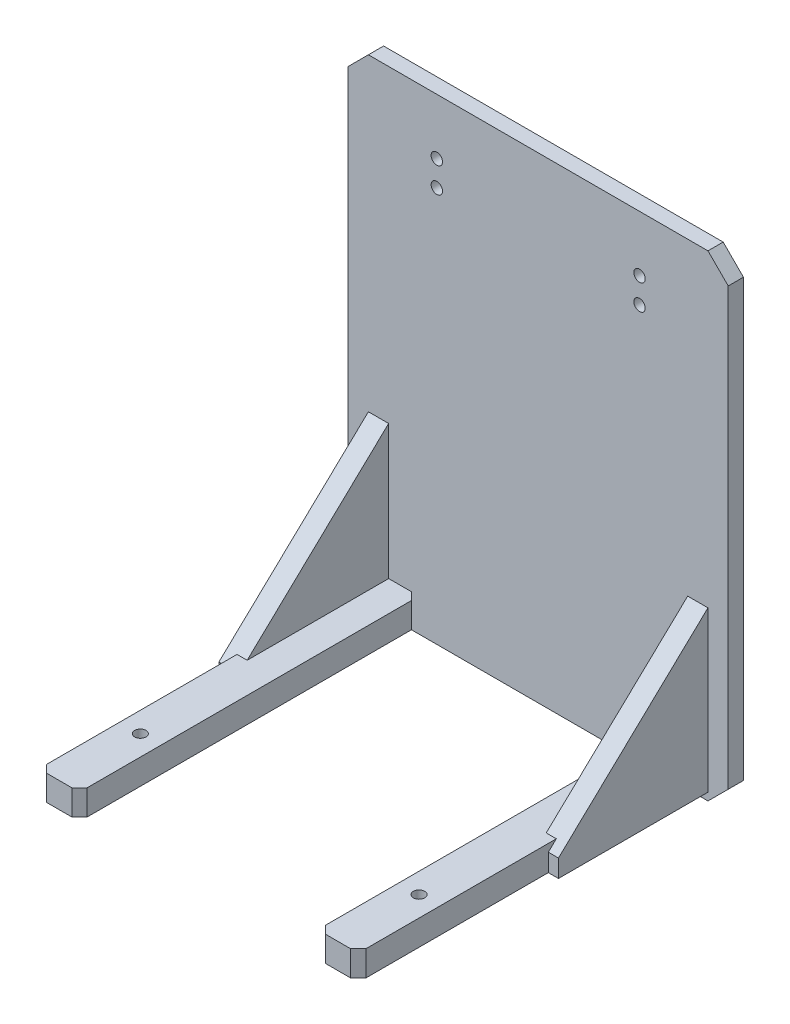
ISO-10303-21;
HEADER;
FILE_DESCRIPTION(('STEP AP214'),'2;1');
FILE_NAME('part.step','',(''),(''),'','','');
FILE_SCHEMA(('AUTOMOTIVE_DESIGN { 1 0 10303 214 1 1 1 1 }'));
ENDSEC;
DATA;
#1=APPLICATION_CONTEXT('core data for automotive mechanical design processes');
#2=APPLICATION_PROTOCOL_DEFINITION('international standard','automotive_design',2000,#1);
#3=PRODUCT_CONTEXT('',#1,'mechanical');
#4=PRODUCT('Part','Part','',(#3));
#5=PRODUCT_RELATED_PRODUCT_CATEGORY('part','',(#4));
#6=PRODUCT_DEFINITION_FORMATION('','',#4);
#7=PRODUCT_DEFINITION_CONTEXT('part definition',#1,'design');
#8=PRODUCT_DEFINITION('design','',#6,#7);
#9=PRODUCT_DEFINITION_SHAPE('','',#8);
#10=(LENGTH_UNIT() NAMED_UNIT(*) SI_UNIT(.MILLI.,.METRE.));
#11=(NAMED_UNIT(*) PLANE_ANGLE_UNIT() SI_UNIT($,.RADIAN.));
#12=(NAMED_UNIT(*) SI_UNIT($,.STERADIAN.) SOLID_ANGLE_UNIT());
#13=UNCERTAINTY_MEASURE_WITH_UNIT(LENGTH_MEASURE(1.E-05),#10,'distance_accuracy_value','');
#14=(GEOMETRIC_REPRESENTATION_CONTEXT(3) GLOBAL_UNCERTAINTY_ASSIGNED_CONTEXT((#13)) GLOBAL_UNIT_ASSIGNED_CONTEXT((#10,
#11,#12)) REPRESENTATION_CONTEXT('',''));
#15=CARTESIAN_POINT('',(0.,0.,0.));
#16=DIRECTION('',(0.,0.,1.));
#17=DIRECTION('',(1.,0.,0.));
#18=AXIS2_PLACEMENT_3D('',#15,#16,#17);
#19=CARTESIAN_POINT('',(0.,0.,6.));
#20=DIRECTION('',(0.,0.,1.));
#21=DIRECTION('',(1.,0.,0.));
#22=AXIS2_PLACEMENT_3D('',#19,#20,#21);
#23=PLANE('',#22);
#24=DIRECTION('',(0.,1.,0.));
#25=VECTOR('',#24,1.);
#26=CARTESIAN_POINT('',(-59.,-105.,6.));
#27=LINE('',#26,#25);
#28=CARTESIAN_POINT('',(-59.,-95.,6.00000000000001));
#29=VERTEX_POINT('',#28);
#30=CARTESIAN_POINT('',(-59.,-42.,6.));
#31=VERTEX_POINT('',#30);
#32=EDGE_CURVE('E277',#29,#31,#27,.T.);
#33=ORIENTED_EDGE('',*,*,#32,.F.);
#34=DIRECTION('',(-1.,0.,0.));
#35=VECTOR('',#34,1.);
#36=CARTESIAN_POINT('',(-60.,-95.,6.00000000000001));
#37=LINE('',#36,#35);
#38=CARTESIAN_POINT('',(-50.,-95.,6.00000000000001));
#39=VERTEX_POINT('',#38);
#40=EDGE_CURVE('E327',#39,#29,#37,.T.);
#41=ORIENTED_EDGE('',*,*,#40,.F.);
#42=DIRECTION('',(0.,-1.,0.));
#43=VECTOR('',#42,1.);
#44=CARTESIAN_POINT('',(-50.,-95.,6.00000000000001));
#45=LINE('',#44,#43);
#46=CARTESIAN_POINT('',(-50.,-105.,6.));
#47=VERTEX_POINT('',#46);
#48=EDGE_CURVE('E330',#39,#47,#45,.T.);
#49=ORIENTED_EDGE('',*,*,#48,.T.);
#50=DIRECTION('',(-1.,0.,0.));
#51=VECTOR('',#50,1.);
#52=CARTESIAN_POINT('',(-60.,-105.,6.00000000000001));
#53=LINE('',#52,#51);
#54=CARTESIAN_POINT('',(-67.,-105.,6.));
#55=VERTEX_POINT('',#54);
#56=EDGE_CURVE('E317',#47,#55,#53,.T.);
#57=ORIENTED_EDGE('',*,*,#56,.T.);
#58=DIRECTION('',(0.,1.,0.));
#59=VECTOR('',#58,1.);
#60=CARTESIAN_POINT('',(-67.,-105.,6.));
#61=LINE('',#60,#59);
#62=CARTESIAN_POINT('',(-67.,-42.,6.));
#63=VERTEX_POINT('',#62);
#64=EDGE_CURVE('E287',#55,#63,#61,.T.);
#65=ORIENTED_EDGE('',*,*,#64,.T.);
#66=DIRECTION('',(-1.,0.,0.));
#67=VECTOR('',#66,1.);
#68=CARTESIAN_POINT('',(-59.,-42.,6.));
#69=LINE('',#68,#67);
#70=EDGE_CURVE('E297',#31,#63,#69,.T.);
#71=ORIENTED_EDGE('',*,*,#70,.F.);
#72=EDGE_LOOP('',(#33,#41,#49,#57,#65,#71));
#73=FACE_BOUND('',#72,.T.);
#74=CARTESIAN_POINT('',(40.,48.,6.));
#75=DIRECTION('',(0.,0.,1.));
#76=DIRECTION('',(1.,0.,0.));
#77=AXIS2_PLACEMENT_3D('',#74,#75,#76);
#78=CIRCLE('',#77,2.25);
#79=CARTESIAN_POINT('',(42.25,48.,6.));
#80=VERTEX_POINT('',#79);
#81=EDGE_CURVE('E420',#80,#80,#78,.T.);
#82=ORIENTED_EDGE('',*,*,#81,.F.);
#83=EDGE_LOOP('',(#82));
#84=FACE_BOUND('',#83,.T.);
#85=CARTESIAN_POINT('',(-40.,48.,6.));
#86=DIRECTION('',(0.,0.,1.));
#87=DIRECTION('',(1.,0.,0.));
#88=AXIS2_PLACEMENT_3D('',#85,#86,#87);
#89=CIRCLE('',#88,2.25);
#90=CARTESIAN_POINT('',(-37.75,48.,6.));
#91=VERTEX_POINT('',#90);
#92=EDGE_CURVE('E432',#91,#91,#89,.T.);
#93=ORIENTED_EDGE('',*,*,#92,.F.);
#94=EDGE_LOOP('',(#93));
#95=FACE_BOUND('',#94,.T.);
#96=DIRECTION('',(0.707106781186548,-0.707106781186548,0.));
#97=VECTOR('',#96,1.);
#98=CARTESIAN_POINT('',(-75.,-100.,6.));
#99=LINE('',#98,#97);
#100=CARTESIAN_POINT('',(-75.,-100.,6.));
#101=VERTEX_POINT('',#100);
#102=CARTESIAN_POINT('',(-67.,-108.,6.));
#103=VERTEX_POINT('',#102);
#104=EDGE_CURVE('E438',#101,#103,#99,.T.);
#105=ORIENTED_EDGE('',*,*,#104,.T.);
#106=DIRECTION('',(1.,0.,0.));
#107=VECTOR('',#106,1.);
#108=CARTESIAN_POINT('',(-67.,-108.,6.));
#109=LINE('',#108,#107);
#110=CARTESIAN_POINT('',(67.,-108.,6.));
#111=VERTEX_POINT('',#110);
#112=EDGE_CURVE('E441',#103,#111,#109,.T.);
#113=ORIENTED_EDGE('',*,*,#112,.T.);
#114=DIRECTION('',(0.707106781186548,0.707106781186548,0.));
#115=VECTOR('',#114,1.);
#116=CARTESIAN_POINT('',(67.,-108.,6.));
#117=LINE('',#116,#115);
#118=CARTESIAN_POINT('',(75.,-100.,6.));
#119=VERTEX_POINT('',#118);
#120=EDGE_CURVE('E444',#111,#119,#117,.T.);
#121=ORIENTED_EDGE('',*,*,#120,.T.);
#122=DIRECTION('',(0.,1.,0.));
#123=VECTOR('',#122,1.);
#124=CARTESIAN_POINT('',(75.,-100.,6.));
#125=LINE('',#124,#123);
#126=CARTESIAN_POINT('',(75.,72.,6.));
#127=VERTEX_POINT('',#126);
#128=EDGE_CURVE('E446',#119,#127,#125,.T.);
#129=ORIENTED_EDGE('',*,*,#128,.T.);
#130=DIRECTION('',(-0.707106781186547,0.707106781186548,0.));
#131=VECTOR('',#130,1.);
#132=CARTESIAN_POINT('',(75.,72.,6.));
#133=LINE('',#132,#131);
#134=CARTESIAN_POINT('',(67.,80.,6.));
#135=VERTEX_POINT('',#134);
#136=EDGE_CURVE('E448',#127,#135,#133,.T.);
#137=ORIENTED_EDGE('',*,*,#136,.T.);
#138=DIRECTION('',(-1.,0.,0.));
#139=VECTOR('',#138,1.);
#140=CARTESIAN_POINT('',(67.,80.,6.));
#141=LINE('',#140,#139);
#142=CARTESIAN_POINT('',(-67.,80.,6.));
#143=VERTEX_POINT('',#142);
#144=EDGE_CURVE('E450',#135,#143,#141,.T.);
#145=ORIENTED_EDGE('',*,*,#144,.T.);
#146=DIRECTION('',(-0.707106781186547,-0.707106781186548,0.));
#147=VECTOR('',#146,1.);
#148=CARTESIAN_POINT('',(-67.,80.,6.));
#149=LINE('',#148,#147);
#150=CARTESIAN_POINT('',(-75.,72.,6.));
#151=VERTEX_POINT('',#150);
#152=EDGE_CURVE('E452',#143,#151,#149,.T.);
#153=ORIENTED_EDGE('',*,*,#152,.T.);
#154=DIRECTION('',(0.,-1.,0.));
#155=VECTOR('',#154,1.);
#156=CARTESIAN_POINT('',(-75.,72.,6.));
#157=LINE('',#156,#155);
#158=EDGE_CURVE('E454',#151,#101,#157,.T.);
#159=ORIENTED_EDGE('',*,*,#158,.T.);
#160=EDGE_LOOP('',(#105,#113,#121,#129,#137,#145,#153,#159));
#161=FACE_BOUND('',#160,.T.);
#162=CARTESIAN_POINT('',(-40.,58.,6.));
#163=DIRECTION('',(0.,0.,1.));
#164=DIRECTION('',(1.,0.,0.));
#165=AXIS2_PLACEMENT_3D('',#162,#163,#164);
#166=CIRCLE('',#165,2.25);
#167=CARTESIAN_POINT('',(-37.75,58.,6.));
#168=VERTEX_POINT('',#167);
#169=EDGE_CURVE('E426',#168,#168,#166,.T.);
#170=ORIENTED_EDGE('',*,*,#169,.F.);
#171=EDGE_LOOP('',(#170));
#172=FACE_BOUND('',#171,.T.);
#173=CARTESIAN_POINT('',(40.,58.,6.));
#174=DIRECTION('',(0.,0.,1.));
#175=DIRECTION('',(1.,0.,0.));
#176=AXIS2_PLACEMENT_3D('',#173,#174,#175);
#177=CIRCLE('',#176,2.25);
#178=CARTESIAN_POINT('',(42.25,58.,6.));
#179=VERTEX_POINT('',#178);
#180=EDGE_CURVE('E414',#179,#179,#177,.T.);
#181=ORIENTED_EDGE('',*,*,#180,.F.);
#182=EDGE_LOOP('',(#181));
#183=FACE_BOUND('',#182,.T.);
#184=DIRECTION('',(0.,1.,0.));
#185=VECTOR('',#184,1.);
#186=CARTESIAN_POINT('',(67.,-105.,6.));
#187=LINE('',#186,#185);
#188=CARTESIAN_POINT('',(67.,-105.,6.));
#189=VERTEX_POINT('',#188);
#190=CARTESIAN_POINT('',(67.,-42.,6.));
#191=VERTEX_POINT('',#190);
#192=EDGE_CURVE('E247',#189,#191,#187,.T.);
#193=ORIENTED_EDGE('',*,*,#192,.F.);
#194=DIRECTION('',(-1.,0.,0.));
#195=VECTOR('',#194,1.);
#196=CARTESIAN_POINT('',(50.,-105.,6.));
#197=LINE('',#196,#195);
#198=CARTESIAN_POINT('',(50.,-105.,6.));
#199=VERTEX_POINT('',#198);
#200=EDGE_CURVE('E58',#189,#199,#197,.T.);
#201=ORIENTED_EDGE('',*,*,#200,.T.);
#202=DIRECTION('',(0.,-1.,0.));
#203=VECTOR('',#202,1.);
#204=CARTESIAN_POINT('',(50.,-95.,6.));
#205=LINE('',#204,#203);
#206=CARTESIAN_POINT('',(50.,-95.,6.));
#207=VERTEX_POINT('',#206);
#208=EDGE_CURVE('E376',#207,#199,#205,.T.);
#209=ORIENTED_EDGE('',*,*,#208,.F.);
#210=DIRECTION('',(-1.,0.,0.));
#211=VECTOR('',#210,1.);
#212=CARTESIAN_POINT('',(50.,-95.,6.));
#213=LINE('',#212,#211);
#214=CARTESIAN_POINT('',(59.,-95.,6.));
#215=VERTEX_POINT('',#214);
#216=EDGE_CURVE('E379',#215,#207,#213,.T.);
#217=ORIENTED_EDGE('',*,*,#216,.F.);
#218=DIRECTION('',(0.,1.,0.));
#219=VECTOR('',#218,1.);
#220=CARTESIAN_POINT('',(59.,-105.,6.));
#221=LINE('',#220,#219);
#222=CARTESIAN_POINT('',(59.,-42.,6.));
#223=VERTEX_POINT('',#222);
#224=EDGE_CURVE('E265',#215,#223,#221,.T.);
#225=ORIENTED_EDGE('',*,*,#224,.T.);
#226=DIRECTION('',(-1.,0.,0.));
#227=VECTOR('',#226,1.);
#228=CARTESIAN_POINT('',(67.,-42.,6.));
#229=LINE('',#228,#227);
#230=EDGE_CURVE('E65',#191,#223,#229,.T.);
#231=ORIENTED_EDGE('',*,*,#230,.F.);
#232=EDGE_LOOP('',(#193,#201,#209,#217,#225,#231));
#233=FACE_BOUND('',#232,.T.);
#234=ADVANCED_FACE('F43',(#73,#84,#95,#161,#172,#183,#233),#23,.T.);
#235=CARTESIAN_POINT('',(0.,-95.,0.));
#236=DIRECTION('',(0.,-1.,0.));
#237=DIRECTION('',(0.,0.,-1.));
#238=AXIS2_PLACEMENT_3D('',#235,#236,#237);
#239=PLANE('',#238);
#240=CARTESIAN_POINT('',(55.,-95.,108.));
#241=DIRECTION('',(0.,1.,0.));
#242=DIRECTION('',(0.,0.,1.));
#243=AXIS2_PLACEMENT_3D('',#240,#241,#242);
#244=CIRCLE('',#243,2.25);
#245=CARTESIAN_POINT('',(55.,-95.,110.25));
#246=VERTEX_POINT('',#245);
#247=EDGE_CURVE('E395',#246,#246,#244,.T.);
#248=ORIENTED_EDGE('',*,*,#247,.F.);
#249=EDGE_LOOP('',(#248));
#250=FACE_BOUND('',#249,.T.);
#251=DIRECTION('',(1.,0.,0.));
#252=VECTOR('',#251,1.);
#253=CARTESIAN_POINT('',(0.,-95.,61.8392857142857));
#254=LINE('',#253,#252);
#255=CARTESIAN_POINT('',(59.,-95.,61.8392857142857));
#256=VERTEX_POINT('',#255);
#257=CARTESIAN_POINT('',(63.,-95.,61.8392857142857));
#258=VERTEX_POINT('',#257);
#259=EDGE_CURVE('E271',#256,#258,#254,.T.);
#260=ORIENTED_EDGE('',*,*,#259,.F.);
#261=DIRECTION('',(0.,0.,1.));
#262=VECTOR('',#261,1.);
#263=CARTESIAN_POINT('',(59.,-95.,0.));
#264=LINE('',#263,#262);
#265=EDGE_CURVE('E273',#215,#256,#264,.T.);
#266=ORIENTED_EDGE('',*,*,#265,.F.);
#267=ORIENTED_EDGE('',*,*,#216,.T.);
#268=DIRECTION('',(-0.707106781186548,0.,0.707106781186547));
#269=VECTOR('',#268,1.);
#270=CARTESIAN_POINT('',(47.,-95.,9.));
#271=LINE('',#270,#269);
#272=CARTESIAN_POINT('',(47.,-95.,9.));
#273=VERTEX_POINT('',#272);
#274=EDGE_CURVE('E382',#207,#273,#271,.T.);
#275=ORIENTED_EDGE('',*,*,#274,.T.);
#276=DIRECTION('',(0.,0.,1.));
#277=VECTOR('',#276,1.);
#278=CARTESIAN_POINT('',(47.,-95.,137.));
#279=LINE('',#278,#277);
#280=CARTESIAN_POINT('',(47.,-95.,137.));
#281=VERTEX_POINT('',#280);
#282=EDGE_CURVE('E406',#273,#281,#279,.T.);
#283=ORIENTED_EDGE('',*,*,#282,.T.);
#284=DIRECTION('',(0.707106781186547,0.,0.707106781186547));
#285=VECTOR('',#284,1.);
#286=CARTESIAN_POINT('',(50.,-95.,140.));
#287=LINE('',#286,#285);
#288=CARTESIAN_POINT('',(50.,-95.,140.));
#289=VERTEX_POINT('',#288);
#290=EDGE_CURVE('E404',#281,#289,#287,.T.);
#291=ORIENTED_EDGE('',*,*,#290,.T.);
#292=DIRECTION('',(1.,0.,0.));
#293=VECTOR('',#292,1.);
#294=CARTESIAN_POINT('',(60.,-95.,140.));
#295=LINE('',#294,#293);
#296=CARTESIAN_POINT('',(60.,-95.,140.));
#297=VERTEX_POINT('',#296);
#298=EDGE_CURVE('E402',#289,#297,#295,.T.);
#299=ORIENTED_EDGE('',*,*,#298,.T.);
#300=DIRECTION('',(0.707106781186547,0.,-0.707106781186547));
#301=VECTOR('',#300,1.);
#302=CARTESIAN_POINT('',(63.,-95.,137.));
#303=LINE('',#302,#301);
#304=CARTESIAN_POINT('',(63.,-95.,137.));
#305=VERTEX_POINT('',#304);
#306=EDGE_CURVE('E400',#297,#305,#303,.T.);
#307=ORIENTED_EDGE('',*,*,#306,.T.);
#308=DIRECTION('',(0.,0.,-1.));
#309=VECTOR('',#308,1.);
#310=CARTESIAN_POINT('',(63.,-95.,9.));
#311=LINE('',#310,#309);
#312=EDGE_CURVE('E397',#305,#258,#311,.T.);
#313=ORIENTED_EDGE('',*,*,#312,.T.);
#314=EDGE_LOOP('',(#260,#266,#267,#275,#283,#291,#299,#307,#313));
#315=FACE_BOUND('',#314,.T.);
#316=ADVANCED_FACE('F536',(#250,#315),#239,.F.);
#317=CARTESIAN_POINT('',(63.,-95.,9.));
#318=DIRECTION('',(-1.,0.,0.));
#319=DIRECTION('',(0.,0.,1.));
#320=AXIS2_PLACEMENT_3D('',#317,#318,#319);
#321=PLANE('',#320);
#322=DIRECTION('',(0.,-0.688426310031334,0.72530629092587));
#323=VECTOR('',#322,1.);
#324=CARTESIAN_POINT('',(63.,-68.6162913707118,34.0421641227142));
#325=LINE('',#324,#323);
#326=CARTESIAN_POINT('',(63.,-98.,65.));
#327=VERTEX_POINT('',#326);
#328=EDGE_CURVE('E11',#258,#327,#325,.T.);
#329=ORIENTED_EDGE('',*,*,#328,.F.);
#330=ORIENTED_EDGE('',*,*,#312,.F.);
#331=DIRECTION('',(0.,-1.,0.));
#332=VECTOR('',#331,1.);
#333=CARTESIAN_POINT('',(63.,-95.,137.));
#334=LINE('',#333,#332);
#335=CARTESIAN_POINT('',(63.,-105.,137.));
#336=VERTEX_POINT('',#335);
#337=EDGE_CURVE('E373',#305,#336,#334,.T.);
#338=ORIENTED_EDGE('',*,*,#337,.T.);
#339=DIRECTION('',(0.,0.,-1.));
#340=VECTOR('',#339,1.);
#341=CARTESIAN_POINT('',(63.,-105.,9.));
#342=LINE('',#341,#340);
#343=CARTESIAN_POINT('',(63.,-105.,65.));
#344=VERTEX_POINT('',#343);
#345=EDGE_CURVE('E381',#336,#344,#342,.T.);
#346=ORIENTED_EDGE('',*,*,#345,.T.);
#347=DIRECTION('',(0.,-1.,0.));
#348=VECTOR('',#347,1.);
#349=CARTESIAN_POINT('',(63.,-95.,65.));
#350=LINE('',#349,#348);
#351=EDGE_CURVE('E51',#327,#344,#350,.T.);
#352=ORIENTED_EDGE('',*,*,#351,.F.);
#353=EDGE_LOOP('',(#329,#330,#338,#346,#352));
#354=FACE_BOUND('',#353,.T.);
#355=ADVANCED_FACE('F507',(#354),#321,.F.);
#356=CARTESIAN_POINT('',(0.,-95.,0.));
#357=DIRECTION('',(0.,-1.,0.));
#358=DIRECTION('',(0.,0.,-1.));
#359=AXIS2_PLACEMENT_3D('',#356,#357,#358);
#360=PLANE('',#359);
#361=CARTESIAN_POINT('',(-55.,-95.,108.));
#362=DIRECTION('',(0.,1.,0.));
#363=DIRECTION('',(0.,0.,1.));
#364=AXIS2_PLACEMENT_3D('',#361,#362,#363);
#365=CIRCLE('',#364,2.25);
#366=CARTESIAN_POINT('',(-55.,-95.,110.25));
#367=VERTEX_POINT('',#366);
#368=EDGE_CURVE('E306',#367,#367,#365,.T.);
#369=ORIENTED_EDGE('',*,*,#368,.F.);
#370=EDGE_LOOP('',(#369));
#371=FACE_BOUND('',#370,.T.);
#372=DIRECTION('',(1.,0.,0.));
#373=VECTOR('',#372,1.);
#374=CARTESIAN_POINT('',(0.,-95.,61.8392857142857));
#375=LINE('',#374,#373);
#376=CARTESIAN_POINT('',(-63.,-95.,61.8392857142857));
#377=VERTEX_POINT('',#376);
#378=CARTESIAN_POINT('',(-59.,-95.,61.8392857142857));
#379=VERTEX_POINT('',#378);
#380=EDGE_CURVE('E300',#377,#379,#375,.T.);
#381=ORIENTED_EDGE('',*,*,#380,.F.);
#382=DIRECTION('',(0.,0.,1.));
#383=VECTOR('',#382,1.);
#384=CARTESIAN_POINT('',(-63.,-95.,137.));
#385=LINE('',#384,#383);
#386=CARTESIAN_POINT('',(-63.,-95.,137.));
#387=VERTEX_POINT('',#386);
#388=EDGE_CURVE('E314',#377,#387,#385,.T.);
#389=ORIENTED_EDGE('',*,*,#388,.T.);
#390=DIRECTION('',(0.707106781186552,0.,0.707106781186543));
#391=VECTOR('',#390,1.);
#392=CARTESIAN_POINT('',(-60.,-95.,140.));
#393=LINE('',#392,#391);
#394=CARTESIAN_POINT('',(-60.,-95.,140.));
#395=VERTEX_POINT('',#394);
#396=EDGE_CURVE('E316',#387,#395,#393,.T.);
#397=ORIENTED_EDGE('',*,*,#396,.T.);
#398=DIRECTION('',(1.,0.,0.));
#399=VECTOR('',#398,1.);
#400=CARTESIAN_POINT('',(-50.,-95.,140.));
#401=LINE('',#400,#399);
#402=CARTESIAN_POINT('',(-50.,-95.,140.));
#403=VERTEX_POINT('',#402);
#404=EDGE_CURVE('E319',#395,#403,#401,.T.);
#405=ORIENTED_EDGE('',*,*,#404,.T.);
#406=DIRECTION('',(0.707106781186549,0.,-0.707106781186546));
#407=VECTOR('',#406,1.);
#408=CARTESIAN_POINT('',(-47.,-95.,137.));
#409=LINE('',#408,#407);
#410=CARTESIAN_POINT('',(-47.,-95.,137.));
#411=VERTEX_POINT('',#410);
#412=EDGE_CURVE('E321',#403,#411,#409,.T.);
#413=ORIENTED_EDGE('',*,*,#412,.T.);
#414=DIRECTION('',(0.,0.,-1.));
#415=VECTOR('',#414,1.);
#416=CARTESIAN_POINT('',(-47.,-95.,9.));
#417=LINE('',#416,#415);
#418=CARTESIAN_POINT('',(-47.,-95.,9.));
#419=VERTEX_POINT('',#418);
#420=EDGE_CURVE('E323',#411,#419,#417,.T.);
#421=ORIENTED_EDGE('',*,*,#420,.T.);
#422=DIRECTION('',(-0.707106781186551,0.,-0.707106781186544));
#423=VECTOR('',#422,1.);
#424=CARTESIAN_POINT('',(-50.,-95.,6.00000000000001));
#425=LINE('',#424,#423);
#426=EDGE_CURVE('E325',#419,#39,#425,.T.);
#427=ORIENTED_EDGE('',*,*,#426,.T.);
#428=ORIENTED_EDGE('',*,*,#40,.T.);
#429=DIRECTION('',(0.,0.,1.));
#430=VECTOR('',#429,1.);
#431=CARTESIAN_POINT('',(-59.,-95.,0.));
#432=LINE('',#431,#430);
#433=EDGE_CURVE('E303',#29,#379,#432,.T.);
#434=ORIENTED_EDGE('',*,*,#433,.T.);
#435=EDGE_LOOP('',(#381,#389,#397,#405,#413,#421,#427,#428,#434));
#436=FACE_BOUND('',#435,.T.);
#437=ADVANCED_FACE('F544',(#371,#436),#360,.F.);
#438=CARTESIAN_POINT('',(-63.,-95.,137.));
#439=DIRECTION('',(1.,0.,0.));
#440=DIRECTION('',(0.,0.,-1.));
#441=AXIS2_PLACEMENT_3D('',#438,#439,#440);
#442=PLANE('',#441);
#443=DIRECTION('',(0.,0.688426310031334,-0.72530629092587));
#444=VECTOR('',#443,1.);
#445=CARTESIAN_POINT('',(-63.,-132.529242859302,101.379023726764));
#446=LINE('',#445,#444);
#447=CARTESIAN_POINT('',(-63.,-98.,65.));
#448=VERTEX_POINT('',#447);
#449=EDGE_CURVE('E498',#448,#377,#446,.T.);
#450=ORIENTED_EDGE('',*,*,#449,.F.);
#451=DIRECTION('',(0.,1.,0.));
#452=VECTOR('',#451,1.);
#453=CARTESIAN_POINT('',(-63.,-95.,65.));
#454=LINE('',#453,#452);
#455=CARTESIAN_POINT('',(-63.,-105.,65.));
#456=VERTEX_POINT('',#455);
#457=EDGE_CURVE('E495',#456,#448,#454,.T.);
#458=ORIENTED_EDGE('',*,*,#457,.F.);
#459=DIRECTION('',(0.,0.,1.));
#460=VECTOR('',#459,1.);
#461=CARTESIAN_POINT('',(-63.,-105.,137.));
#462=LINE('',#461,#460);
#463=CARTESIAN_POINT('',(-63.,-105.,137.));
#464=VERTEX_POINT('',#463);
#465=EDGE_CURVE('E309',#456,#464,#462,.T.);
#466=ORIENTED_EDGE('',*,*,#465,.T.);
#467=DIRECTION('',(0.,-1.,0.));
#468=VECTOR('',#467,1.);
#469=CARTESIAN_POINT('',(-63.,-95.,137.));
#470=LINE('',#469,#468);
#471=EDGE_CURVE('E358',#387,#464,#470,.T.);
#472=ORIENTED_EDGE('',*,*,#471,.F.);
#473=ORIENTED_EDGE('',*,*,#388,.F.);
#474=EDGE_LOOP('',(#450,#458,#466,#472,#473));
#475=FACE_BOUND('',#474,.T.);
#476=ADVANCED_FACE('F576',(#475),#442,.F.);
#477=CARTESIAN_POINT('',(0.,0.,0.));
#478=DIRECTION('',(0.,0.,1.));
#479=DIRECTION('',(1.,0.,0.));
#480=AXIS2_PLACEMENT_3D('',#477,#478,#479);
#481=PLANE('',#480);
#482=DIRECTION('',(0.707106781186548,-0.707106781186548,0.));
#483=VECTOR('',#482,1.);
#484=CARTESIAN_POINT('',(-75.,-100.,0.));
#485=LINE('',#484,#483);
#486=CARTESIAN_POINT('',(-75.,-100.,0.));
#487=VERTEX_POINT('',#486);
#488=CARTESIAN_POINT('',(-67.,-108.,0.));
#489=VERTEX_POINT('',#488);
#490=EDGE_CURVE('E435',#487,#489,#485,.T.);
#491=ORIENTED_EDGE('',*,*,#490,.F.);
#492=DIRECTION('',(0.,-1.,0.));
#493=VECTOR('',#492,1.);
#494=CARTESIAN_POINT('',(-75.,72.,0.));
#495=LINE('',#494,#493);
#496=CARTESIAN_POINT('',(-75.,72.,0.));
#497=VERTEX_POINT('',#496);
#498=EDGE_CURVE('E442',#497,#487,#495,.T.);
#499=ORIENTED_EDGE('',*,*,#498,.F.);
#500=DIRECTION('',(-0.707106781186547,-0.707106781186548,0.));
#501=VECTOR('',#500,1.);
#502=CARTESIAN_POINT('',(-67.,80.,0.));
#503=LINE('',#502,#501);
#504=CARTESIAN_POINT('',(-67.,80.,0.));
#505=VERTEX_POINT('',#504);
#506=EDGE_CURVE('E469',#505,#497,#503,.T.);
#507=ORIENTED_EDGE('',*,*,#506,.F.);
#508=DIRECTION('',(-1.,0.,0.));
#509=VECTOR('',#508,1.);
#510=CARTESIAN_POINT('',(67.,80.,0.));
#511=LINE('',#510,#509);
#512=CARTESIAN_POINT('',(67.,80.,0.));
#513=VERTEX_POINT('',#512);
#514=EDGE_CURVE('E467',#513,#505,#511,.T.);
#515=ORIENTED_EDGE('',*,*,#514,.F.);
#516=DIRECTION('',(-0.707106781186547,0.707106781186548,0.));
#517=VECTOR('',#516,1.);
#518=CARTESIAN_POINT('',(75.,72.,0.));
#519=LINE('',#518,#517);
#520=CARTESIAN_POINT('',(75.,72.,0.));
#521=VERTEX_POINT('',#520);
#522=EDGE_CURVE('E465',#521,#513,#519,.T.);
#523=ORIENTED_EDGE('',*,*,#522,.F.);
#524=DIRECTION('',(0.,1.,0.));
#525=VECTOR('',#524,1.);
#526=CARTESIAN_POINT('',(75.,-100.,0.));
#527=LINE('',#526,#525);
#528=CARTESIAN_POINT('',(75.,-100.,0.));
#529=VERTEX_POINT('',#528);
#530=EDGE_CURVE('E463',#529,#521,#527,.T.);
#531=ORIENTED_EDGE('',*,*,#530,.F.);
#532=DIRECTION('',(0.707106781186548,0.707106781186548,0.));
#533=VECTOR('',#532,1.);
#534=CARTESIAN_POINT('',(67.,-108.,0.));
#535=LINE('',#534,#533);
#536=CARTESIAN_POINT('',(67.,-108.,0.));
#537=VERTEX_POINT('',#536);
#538=EDGE_CURVE('E461',#537,#529,#535,.T.);
#539=ORIENTED_EDGE('',*,*,#538,.F.);
#540=DIRECTION('',(1.,0.,0.));
#541=VECTOR('',#540,1.);
#542=CARTESIAN_POINT('',(-67.,-108.,0.));
#543=LINE('',#542,#541);
#544=EDGE_CURVE('E459',#489,#537,#543,.T.);
#545=ORIENTED_EDGE('',*,*,#544,.F.);
#546=EDGE_LOOP('',(#491,#499,#507,#515,#523,#531,#539,#545));
#547=FACE_BOUND('',#546,.T.);
#548=CARTESIAN_POINT('',(-40.,48.,0.));
#549=DIRECTION('',(0.,0.,1.));
#550=DIRECTION('',(1.,0.,0.));
#551=AXIS2_PLACEMENT_3D('',#548,#549,#550);
#552=CIRCLE('',#551,2.25);
#553=CARTESIAN_POINT('',(-37.75,48.,0.));
#554=VERTEX_POINT('',#553);
#555=EDGE_CURVE('E429',#554,#554,#552,.T.);
#556=ORIENTED_EDGE('',*,*,#555,.T.);
#557=EDGE_LOOP('',(#556));
#558=FACE_BOUND('',#557,.T.);
#559=CARTESIAN_POINT('',(-40.,58.,0.));
#560=DIRECTION('',(0.,0.,1.));
#561=DIRECTION('',(1.,0.,0.));
#562=AXIS2_PLACEMENT_3D('',#559,#560,#561);
#563=CIRCLE('',#562,2.25);
#564=CARTESIAN_POINT('',(-37.75,58.,0.));
#565=VERTEX_POINT('',#564);
#566=EDGE_CURVE('E423',#565,#565,#563,.T.);
#567=ORIENTED_EDGE('',*,*,#566,.T.);
#568=EDGE_LOOP('',(#567));
#569=FACE_BOUND('',#568,.T.);
#570=CARTESIAN_POINT('',(40.,48.,0.));
#571=DIRECTION('',(0.,0.,1.));
#572=DIRECTION('',(1.,0.,0.));
#573=AXIS2_PLACEMENT_3D('',#570,#571,#572);
#574=CIRCLE('',#573,2.25);
#575=CARTESIAN_POINT('',(42.25,48.,0.));
#576=VERTEX_POINT('',#575);
#577=EDGE_CURVE('E417',#576,#576,#574,.T.);
#578=ORIENTED_EDGE('',*,*,#577,.T.);
#579=EDGE_LOOP('',(#578));
#580=FACE_BOUND('',#579,.T.);
#581=CARTESIAN_POINT('',(40.,58.,0.));
#582=DIRECTION('',(0.,0.,1.));
#583=DIRECTION('',(1.,0.,0.));
#584=AXIS2_PLACEMENT_3D('',#581,#582,#583);
#585=CIRCLE('',#584,2.25);
#586=CARTESIAN_POINT('',(42.25,58.,0.));
#587=VERTEX_POINT('',#586);
#588=EDGE_CURVE('E361',#587,#587,#585,.T.);
#589=ORIENTED_EDGE('',*,*,#588,.T.);
#590=EDGE_LOOP('',(#589));
#591=FACE_BOUND('',#590,.T.);
#592=ADVANCED_FACE('F573',(#547,#558,#569,#580,#591),#481,.F.);
#593=CARTESIAN_POINT('',(-75.,-100.,6.));
#594=DIRECTION('',(0.707106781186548,0.707106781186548,0.));
#595=DIRECTION('',(-0.707106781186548,0.707106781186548,0.));
#596=AXIS2_PLACEMENT_3D('',#593,#594,#595);
#597=PLANE('',#596);
#598=ORIENTED_EDGE('',*,*,#490,.T.);
#599=DIRECTION('',(0.,0.,-1.));
#600=VECTOR('',#599,1.);
#601=CARTESIAN_POINT('',(-67.,-108.,6.));
#602=LINE('',#601,#600);
#603=EDGE_CURVE('E492',#103,#489,#602,.T.);
#604=ORIENTED_EDGE('',*,*,#603,.F.);
#605=ORIENTED_EDGE('',*,*,#104,.F.);
#606=DIRECTION('',(0.,0.,-1.));
#607=VECTOR('',#606,1.);
#608=CARTESIAN_POINT('',(-75.,-100.,6.));
#609=LINE('',#608,#607);
#610=EDGE_CURVE('E456',#101,#487,#609,.T.);
#611=ORIENTED_EDGE('',*,*,#610,.T.);
#612=EDGE_LOOP('',(#598,#604,#605,#611));
#613=FACE_BOUND('',#612,.T.);
#614=ADVANCED_FACE('F45',(#613),#597,.F.);
#615=CARTESIAN_POINT('',(-67.,-108.,6.));
#616=DIRECTION('',(0.,1.,0.));
#617=DIRECTION('',(0.,0.,1.));
#618=AXIS2_PLACEMENT_3D('',#615,#616,#617);
#619=PLANE('',#618);
#620=ORIENTED_EDGE('',*,*,#544,.T.);
#621=DIRECTION('',(0.,0.,-1.));
#622=VECTOR('',#621,1.);
#623=CARTESIAN_POINT('',(67.,-108.,6.));
#624=LINE('',#623,#622);
#625=EDGE_CURVE('E489',#111,#537,#624,.T.);
#626=ORIENTED_EDGE('',*,*,#625,.F.);
#627=ORIENTED_EDGE('',*,*,#112,.F.);
#628=ORIENTED_EDGE('',*,*,#603,.T.);
#629=EDGE_LOOP('',(#620,#626,#627,#628));
#630=FACE_BOUND('',#629,.T.);
#631=ADVANCED_FACE('F599',(#630),#619,.F.);
#632=CARTESIAN_POINT('',(67.,-108.,6.));
#633=DIRECTION('',(-0.707106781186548,0.707106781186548,0.));
#634=DIRECTION('',(-0.707106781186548,-0.707106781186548,0.));
#635=AXIS2_PLACEMENT_3D('',#632,#633,#634);
#636=PLANE('',#635);
#637=ORIENTED_EDGE('',*,*,#538,.T.);
#638=DIRECTION('',(0.,0.,-1.));
#639=VECTOR('',#638,1.);
#640=CARTESIAN_POINT('',(75.,-100.,6.));
#641=LINE('',#640,#639);
#642=EDGE_CURVE('E486',#119,#529,#641,.T.);
#643=ORIENTED_EDGE('',*,*,#642,.F.);
#644=ORIENTED_EDGE('',*,*,#120,.F.);
#645=ORIENTED_EDGE('',*,*,#625,.T.);
#646=EDGE_LOOP('',(#637,#643,#644,#645));
#647=FACE_BOUND('',#646,.T.);
#648=ADVANCED_FACE('F596',(#647),#636,.F.);
#649=CARTESIAN_POINT('',(75.,-100.,6.));
#650=DIRECTION('',(-1.,0.,0.));
#651=DIRECTION('',(0.,0.,1.));
#652=AXIS2_PLACEMENT_3D('',#649,#650,#651);
#653=PLANE('',#652);
#654=ORIENTED_EDGE('',*,*,#530,.T.);
#655=DIRECTION('',(0.,0.,-1.));
#656=VECTOR('',#655,1.);
#657=CARTESIAN_POINT('',(75.,72.,6.));
#658=LINE('',#657,#656);
#659=EDGE_CURVE('E483',#127,#521,#658,.T.);
#660=ORIENTED_EDGE('',*,*,#659,.F.);
#661=ORIENTED_EDGE('',*,*,#128,.F.);
#662=ORIENTED_EDGE('',*,*,#642,.T.);
#663=EDGE_LOOP('',(#654,#660,#661,#662));
#664=FACE_BOUND('',#663,.T.);
#665=ADVANCED_FACE('F592',(#664),#653,.F.);
#666=CARTESIAN_POINT('',(75.,72.,6.));
#667=DIRECTION('',(-0.707106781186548,-0.707106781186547,0.));
#668=DIRECTION('',(0.707106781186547,-0.707106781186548,0.));
#669=AXIS2_PLACEMENT_3D('',#666,#667,#668);
#670=PLANE('',#669);
#671=ORIENTED_EDGE('',*,*,#522,.T.);
#672=DIRECTION('',(0.,0.,-1.));
#673=VECTOR('',#672,1.);
#674=CARTESIAN_POINT('',(67.,80.,6.));
#675=LINE('',#674,#673);
#676=EDGE_CURVE('E480',#135,#513,#675,.T.);
#677=ORIENTED_EDGE('',*,*,#676,.F.);
#678=ORIENTED_EDGE('',*,*,#136,.F.);
#679=ORIENTED_EDGE('',*,*,#659,.T.);
#680=EDGE_LOOP('',(#671,#677,#678,#679));
#681=FACE_BOUND('',#680,.T.);
#682=ADVANCED_FACE('F588',(#681),#670,.F.);
#683=CARTESIAN_POINT('',(67.,80.,6.));
#684=DIRECTION('',(0.,-1.,0.));
#685=DIRECTION('',(0.,0.,-1.));
#686=AXIS2_PLACEMENT_3D('',#683,#684,#685);
#687=PLANE('',#686);
#688=ORIENTED_EDGE('',*,*,#514,.T.);
#689=DIRECTION('',(0.,0.,-1.));
#690=VECTOR('',#689,1.);
#691=CARTESIAN_POINT('',(-67.,80.,6.));
#692=LINE('',#691,#690);
#693=EDGE_CURVE('E477',#143,#505,#692,.T.);
#694=ORIENTED_EDGE('',*,*,#693,.F.);
#695=ORIENTED_EDGE('',*,*,#144,.F.);
#696=ORIENTED_EDGE('',*,*,#676,.T.);
#697=EDGE_LOOP('',(#688,#694,#695,#696));
#698=FACE_BOUND('',#697,.T.);
#699=ADVANCED_FACE('F584',(#698),#687,.F.);
#700=CARTESIAN_POINT('',(-67.,80.,6.));
#701=DIRECTION('',(0.707106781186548,-0.707106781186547,0.));
#702=DIRECTION('',(0.707106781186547,0.707106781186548,0.));
#703=AXIS2_PLACEMENT_3D('',#700,#701,#702);
#704=PLANE('',#703);
#705=ORIENTED_EDGE('',*,*,#506,.T.);
#706=DIRECTION('',(0.,0.,-1.));
#707=VECTOR('',#706,1.);
#708=CARTESIAN_POINT('',(-75.,72.,6.));
#709=LINE('',#708,#707);
#710=EDGE_CURVE('E474',#151,#497,#709,.T.);
#711=ORIENTED_EDGE('',*,*,#710,.F.);
#712=ORIENTED_EDGE('',*,*,#152,.F.);
#713=ORIENTED_EDGE('',*,*,#693,.T.);
#714=EDGE_LOOP('',(#705,#711,#712,#713));
#715=FACE_BOUND('',#714,.T.);
#716=ADVANCED_FACE('F580',(#715),#704,.F.);
#717=CARTESIAN_POINT('',(-75.,72.,6.));
#718=DIRECTION('',(1.,0.,0.));
#719=DIRECTION('',(0.,0.,-1.));
#720=AXIS2_PLACEMENT_3D('',#717,#718,#719);
#721=PLANE('',#720);
#722=ORIENTED_EDGE('',*,*,#498,.T.);
#723=ORIENTED_EDGE('',*,*,#610,.F.);
#724=ORIENTED_EDGE('',*,*,#158,.F.);
#725=ORIENTED_EDGE('',*,*,#710,.T.);
#726=EDGE_LOOP('',(#722,#723,#724,#725));
#727=FACE_BOUND('',#726,.T.);
#728=ADVANCED_FACE('F570',(#727),#721,.F.);
#729=CARTESIAN_POINT('',(-40.,48.,6.));
#730=DIRECTION('',(0.,0.,-1.));
#731=DIRECTION('',(-1.,0.,0.));
#732=AXIS2_PLACEMENT_3D('',#729,#730,#731);
#733=CYLINDRICAL_SURFACE('',#732,2.25);
#734=ORIENTED_EDGE('',*,*,#92,.T.);
#735=EDGE_LOOP('',(#734));
#736=FACE_BOUND('',#735,.T.);
#737=ORIENTED_EDGE('',*,*,#555,.F.);
#738=EDGE_LOOP('',(#737));
#739=FACE_BOUND('',#738,.T.);
#740=ADVANCED_FACE('F567',(#736,#739),#733,.F.);
#741=CARTESIAN_POINT('',(-40.,58.,6.));
#742=DIRECTION('',(0.,0.,-1.));
#743=DIRECTION('',(-1.,0.,0.));
#744=AXIS2_PLACEMENT_3D('',#741,#742,#743);
#745=CYLINDRICAL_SURFACE('',#744,2.25);
#746=ORIENTED_EDGE('',*,*,#169,.T.);
#747=EDGE_LOOP('',(#746));
#748=FACE_BOUND('',#747,.T.);
#749=ORIENTED_EDGE('',*,*,#566,.F.);
#750=EDGE_LOOP('',(#749));
#751=FACE_BOUND('',#750,.T.);
#752=ADVANCED_FACE('F563',(#748,#751),#745,.F.);
#753=CARTESIAN_POINT('',(40.,48.,6.));
#754=DIRECTION('',(0.,0.,-1.));
#755=DIRECTION('',(-1.,0.,0.));
#756=AXIS2_PLACEMENT_3D('',#753,#754,#755);
#757=CYLINDRICAL_SURFACE('',#756,2.25);
#758=ORIENTED_EDGE('',*,*,#81,.T.);
#759=EDGE_LOOP('',(#758));
#760=FACE_BOUND('',#759,.T.);
#761=ORIENTED_EDGE('',*,*,#577,.F.);
#762=EDGE_LOOP('',(#761));
#763=FACE_BOUND('',#762,.T.);
#764=ADVANCED_FACE('F559',(#760,#763),#757,.F.);
#765=CARTESIAN_POINT('',(40.,58.,6.));
#766=DIRECTION('',(0.,0.,-1.));
#767=DIRECTION('',(-1.,0.,0.));
#768=AXIS2_PLACEMENT_3D('',#765,#766,#767);
#769=CYLINDRICAL_SURFACE('',#768,2.25);
#770=ORIENTED_EDGE('',*,*,#180,.T.);
#771=EDGE_LOOP('',(#770));
#772=FACE_BOUND('',#771,.T.);
#773=ORIENTED_EDGE('',*,*,#588,.F.);
#774=EDGE_LOOP('',(#773));
#775=FACE_BOUND('',#774,.T.);
#776=ADVANCED_FACE('F556',(#772,#775),#769,.F.);
#777=CARTESIAN_POINT('',(0.,-105.,0.));
#778=DIRECTION('',(0.,-1.,0.));
#779=DIRECTION('',(0.,0.,-1.));
#780=AXIS2_PLACEMENT_3D('',#777,#778,#779);
#781=PLANE('',#780);
#782=DIRECTION('',(-1.,0.,0.));
#783=VECTOR('',#782,1.);
#784=CARTESIAN_POINT('',(67.,-105.,65.));
#785=LINE('',#784,#783);
#786=CARTESIAN_POINT('',(67.,-105.,65.));
#787=VERTEX_POINT('',#786);
#788=EDGE_CURVE('E257',#787,#344,#785,.T.);
#789=ORIENTED_EDGE('',*,*,#788,.T.);
#790=ORIENTED_EDGE('',*,*,#345,.F.);
#791=DIRECTION('',(0.707106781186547,0.,-0.707106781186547));
#792=VECTOR('',#791,1.);
#793=CARTESIAN_POINT('',(63.,-105.,137.));
#794=LINE('',#793,#792);
#795=CARTESIAN_POINT('',(60.,-105.,140.));
#796=VERTEX_POINT('',#795);
#797=EDGE_CURVE('E384',#796,#336,#794,.T.);
#798=ORIENTED_EDGE('',*,*,#797,.F.);
#799=DIRECTION('',(1.,0.,0.));
#800=VECTOR('',#799,1.);
#801=CARTESIAN_POINT('',(60.,-105.,140.));
#802=LINE('',#801,#800);
#803=CARTESIAN_POINT('',(50.,-105.,140.));
#804=VERTEX_POINT('',#803);
#805=EDGE_CURVE('E386',#804,#796,#802,.T.);
#806=ORIENTED_EDGE('',*,*,#805,.F.);
#807=DIRECTION('',(0.707106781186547,0.,0.707106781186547));
#808=VECTOR('',#807,1.);
#809=CARTESIAN_POINT('',(50.,-105.,140.));
#810=LINE('',#809,#808);
#811=CARTESIAN_POINT('',(47.,-105.,137.));
#812=VERTEX_POINT('',#811);
#813=EDGE_CURVE('E388',#812,#804,#810,.T.);
#814=ORIENTED_EDGE('',*,*,#813,.F.);
#815=DIRECTION('',(0.,0.,1.));
#816=VECTOR('',#815,1.);
#817=CARTESIAN_POINT('',(47.,-105.,137.));
#818=LINE('',#817,#816);
#819=CARTESIAN_POINT('',(47.,-105.,9.));
#820=VERTEX_POINT('',#819);
#821=EDGE_CURVE('E390',#820,#812,#818,.T.);
#822=ORIENTED_EDGE('',*,*,#821,.F.);
#823=DIRECTION('',(-0.707106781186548,0.,0.707106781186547));
#824=VECTOR('',#823,1.);
#825=CARTESIAN_POINT('',(47.,-105.,9.));
#826=LINE('',#825,#824);
#827=EDGE_CURVE('E392',#199,#820,#826,.T.);
#828=ORIENTED_EDGE('',*,*,#827,.F.);
#829=ORIENTED_EDGE('',*,*,#200,.F.);
#830=DIRECTION('',(0.,0.,-1.));
#831=VECTOR('',#830,1.);
#832=CARTESIAN_POINT('',(67.,-105.,65.));
#833=LINE('',#832,#831);
#834=EDGE_CURVE('E268',#787,#189,#833,.T.);
#835=ORIENTED_EDGE('',*,*,#834,.F.);
#836=EDGE_LOOP('',(#789,#790,#798,#806,#814,#822,#828,#829,#835));
#837=FACE_BOUND('',#836,.T.);
#838=CARTESIAN_POINT('',(55.,-105.,108.));
#839=DIRECTION('',(0.,1.,0.));
#840=DIRECTION('',(0.,0.,1.));
#841=AXIS2_PLACEMENT_3D('',#838,#839,#840);
#842=CIRCLE('',#841,2.25);
#843=CARTESIAN_POINT('',(55.,-105.,110.25));
#844=VERTEX_POINT('',#843);
#845=EDGE_CURVE('E313',#844,#844,#842,.T.);
#846=ORIENTED_EDGE('',*,*,#845,.T.);
#847=EDGE_LOOP('',(#846));
#848=FACE_BOUND('',#847,.T.);
#849=ADVANCED_FACE('F502',(#837,#848),#781,.T.);
#850=CARTESIAN_POINT('',(47.,-95.,9.));
#851=DIRECTION('',(0.707106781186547,0.,0.707106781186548));
#852=DIRECTION('',(0.707106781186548,0.,-0.707106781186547));
#853=AXIS2_PLACEMENT_3D('',#850,#851,#852);
#854=PLANE('',#853);
#855=ORIENTED_EDGE('',*,*,#827,.T.);
#856=DIRECTION('',(0.,-1.,0.));
#857=VECTOR('',#856,1.);
#858=CARTESIAN_POINT('',(47.,-95.,9.));
#859=LINE('',#858,#857);
#860=EDGE_CURVE('E305',#273,#820,#859,.T.);
#861=ORIENTED_EDGE('',*,*,#860,.F.);
#862=ORIENTED_EDGE('',*,*,#274,.F.);
#863=ORIENTED_EDGE('',*,*,#208,.T.);
#864=EDGE_LOOP('',(#855,#861,#862,#863));
#865=FACE_BOUND('',#864,.T.);
#866=ADVANCED_FACE('F528',(#865),#854,.F.);
#867=CARTESIAN_POINT('',(47.,-95.,137.));
#868=DIRECTION('',(1.,0.,0.));
#869=DIRECTION('',(0.,0.,-1.));
#870=AXIS2_PLACEMENT_3D('',#867,#868,#869);
#871=PLANE('',#870);
#872=ORIENTED_EDGE('',*,*,#821,.T.);
#873=DIRECTION('',(0.,-1.,0.));
#874=VECTOR('',#873,1.);
#875=CARTESIAN_POINT('',(47.,-95.,137.));
#876=LINE('',#875,#874);
#877=EDGE_CURVE('E364',#281,#812,#876,.T.);
#878=ORIENTED_EDGE('',*,*,#877,.F.);
#879=ORIENTED_EDGE('',*,*,#282,.F.);
#880=ORIENTED_EDGE('',*,*,#860,.T.);
#881=EDGE_LOOP('',(#872,#878,#879,#880));
#882=FACE_BOUND('',#881,.T.);
#883=ADVANCED_FACE('F524',(#882),#871,.F.);
#884=CARTESIAN_POINT('',(50.,-95.,140.));
#885=DIRECTION('',(0.707106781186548,0.,-0.707106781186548));
#886=DIRECTION('',(-0.707106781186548,0.,-0.707106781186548));
#887=AXIS2_PLACEMENT_3D('',#884,#885,#886);
#888=PLANE('',#887);
#889=ORIENTED_EDGE('',*,*,#813,.T.);
#890=DIRECTION('',(0.,-1.,0.));
#891=VECTOR('',#890,1.);
#892=CARTESIAN_POINT('',(50.,-95.,140.));
#893=LINE('',#892,#891);
#894=EDGE_CURVE('E367',#289,#804,#893,.T.);
#895=ORIENTED_EDGE('',*,*,#894,.F.);
#896=ORIENTED_EDGE('',*,*,#290,.F.);
#897=ORIENTED_EDGE('',*,*,#877,.T.);
#898=EDGE_LOOP('',(#889,#895,#896,#897));
#899=FACE_BOUND('',#898,.T.);
#900=ADVANCED_FACE('F520',(#899),#888,.F.);
#901=CARTESIAN_POINT('',(60.,-95.,140.));
#902=DIRECTION('',(0.,0.,-1.));
#903=DIRECTION('',(-1.,0.,0.));
#904=AXIS2_PLACEMENT_3D('',#901,#902,#903);
#905=PLANE('',#904);
#906=ORIENTED_EDGE('',*,*,#805,.T.);
#907=DIRECTION('',(0.,-1.,0.));
#908=VECTOR('',#907,1.);
#909=CARTESIAN_POINT('',(60.,-95.,140.));
#910=LINE('',#909,#908);
#911=EDGE_CURVE('E370',#297,#796,#910,.T.);
#912=ORIENTED_EDGE('',*,*,#911,.F.);
#913=ORIENTED_EDGE('',*,*,#298,.F.);
#914=ORIENTED_EDGE('',*,*,#894,.T.);
#915=EDGE_LOOP('',(#906,#912,#913,#914));
#916=FACE_BOUND('',#915,.T.);
#917=ADVANCED_FACE('F516',(#916),#905,.F.);
#918=CARTESIAN_POINT('',(63.,-95.,137.));
#919=DIRECTION('',(-0.707106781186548,0.,-0.707106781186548));
#920=DIRECTION('',(-0.707106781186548,0.,0.707106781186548));
#921=AXIS2_PLACEMENT_3D('',#918,#919,#920);
#922=PLANE('',#921);
#923=ORIENTED_EDGE('',*,*,#797,.T.);
#924=ORIENTED_EDGE('',*,*,#337,.F.);
#925=ORIENTED_EDGE('',*,*,#306,.F.);
#926=ORIENTED_EDGE('',*,*,#911,.T.);
#927=EDGE_LOOP('',(#923,#924,#925,#926));
#928=FACE_BOUND('',#927,.T.);
#929=ADVANCED_FACE('F512',(#928),#922,.F.);
#930=CARTESIAN_POINT('',(55.,-95.,108.));
#931=DIRECTION('',(0.,-1.,0.));
#932=DIRECTION('',(0.,0.,-1.));
#933=AXIS2_PLACEMENT_3D('',#930,#931,#932);
#934=CYLINDRICAL_SURFACE('',#933,2.25);
#935=ORIENTED_EDGE('',*,*,#247,.T.);
#936=EDGE_LOOP('',(#935));
#937=FACE_BOUND('',#936,.T.);
#938=ORIENTED_EDGE('',*,*,#845,.F.);
#939=EDGE_LOOP('',(#938));
#940=FACE_BOUND('',#939,.T.);
#941=ADVANCED_FACE('F551',(#937,#940),#934,.F.);
#942=CARTESIAN_POINT('',(0.,-105.,0.));
#943=DIRECTION('',(0.,-1.,0.));
#944=DIRECTION('',(0.,0.,-1.));
#945=AXIS2_PLACEMENT_3D('',#942,#943,#944);
#946=PLANE('',#945);
#947=ORIENTED_EDGE('',*,*,#465,.F.);
#948=DIRECTION('',(-1.,0.,0.));
#949=VECTOR('',#948,1.);
#950=CARTESIAN_POINT('',(-59.,-105.,65.));
#951=LINE('',#950,#949);
#952=CARTESIAN_POINT('',(-67.,-105.,65.));
#953=VERTEX_POINT('',#952);
#954=EDGE_CURVE('E284',#456,#953,#951,.T.);
#955=ORIENTED_EDGE('',*,*,#954,.T.);
#956=DIRECTION('',(0.,0.,-1.));
#957=VECTOR('',#956,1.);
#958=CARTESIAN_POINT('',(-67.,-105.,65.));
#959=LINE('',#958,#957);
#960=EDGE_CURVE('E276',#953,#55,#959,.T.);
#961=ORIENTED_EDGE('',*,*,#960,.T.);
#962=ORIENTED_EDGE('',*,*,#56,.F.);
#963=DIRECTION('',(-0.707106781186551,0.,-0.707106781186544));
#964=VECTOR('',#963,1.);
#965=CARTESIAN_POINT('',(-50.,-105.,6.00000000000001));
#966=LINE('',#965,#964);
#967=CARTESIAN_POINT('',(-47.,-105.,9.));
#968=VERTEX_POINT('',#967);
#969=EDGE_CURVE('E340',#968,#47,#966,.T.);
#970=ORIENTED_EDGE('',*,*,#969,.F.);
#971=DIRECTION('',(0.,0.,-1.));
#972=VECTOR('',#971,1.);
#973=CARTESIAN_POINT('',(-47.,-105.,9.));
#974=LINE('',#973,#972);
#975=CARTESIAN_POINT('',(-47.,-105.,137.));
#976=VERTEX_POINT('',#975);
#977=EDGE_CURVE('E338',#976,#968,#974,.T.);
#978=ORIENTED_EDGE('',*,*,#977,.F.);
#979=DIRECTION('',(0.707106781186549,0.,-0.707106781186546));
#980=VECTOR('',#979,1.);
#981=CARTESIAN_POINT('',(-47.,-105.,137.));
#982=LINE('',#981,#980);
#983=CARTESIAN_POINT('',(-50.,-105.,140.));
#984=VERTEX_POINT('',#983);
#985=EDGE_CURVE('E336',#984,#976,#982,.T.);
#986=ORIENTED_EDGE('',*,*,#985,.F.);
#987=DIRECTION('',(1.,0.,0.));
#988=VECTOR('',#987,1.);
#989=CARTESIAN_POINT('',(-50.,-105.,140.));
#990=LINE('',#989,#988);
#991=CARTESIAN_POINT('',(-60.,-105.,140.));
#992=VERTEX_POINT('',#991);
#993=EDGE_CURVE('E334',#992,#984,#990,.T.);
#994=ORIENTED_EDGE('',*,*,#993,.F.);
#995=DIRECTION('',(0.707106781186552,0.,0.707106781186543));
#996=VECTOR('',#995,1.);
#997=CARTESIAN_POINT('',(-60.,-105.,140.));
#998=LINE('',#997,#996);
#999=EDGE_CURVE('E332',#464,#992,#998,.T.);
#1000=ORIENTED_EDGE('',*,*,#999,.F.);
#1001=EDGE_LOOP('',(#947,#955,#961,#962,#970,#978,#986,#994,#1000));
#1002=FACE_BOUND('',#1001,.T.);
#1003=CARTESIAN_POINT('',(-55.,-105.,108.));
#1004=DIRECTION('',(0.,1.,0.));
#1005=DIRECTION('',(0.,0.,1.));
#1006=AXIS2_PLACEMENT_3D('',#1003,#1004,#1005);
#1007=CIRCLE('',#1006,2.25);
#1008=CARTESIAN_POINT('',(-55.,-105.,110.25));
#1009=VERTEX_POINT('',#1008);
#1010=EDGE_CURVE('E310',#1009,#1009,#1007,.T.);
#1011=ORIENTED_EDGE('',*,*,#1010,.T.);
#1012=EDGE_LOOP('',(#1011));
#1013=FACE_BOUND('',#1012,.T.);
#1014=ADVANCED_FACE('F554',(#1002,#1013),#946,.T.);
#1015=CARTESIAN_POINT('',(-60.,-95.,140.));
#1016=DIRECTION('',(0.707106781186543,0.,-0.707106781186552));
#1017=DIRECTION('',(-0.707106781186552,0.,-0.707106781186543));
#1018=AXIS2_PLACEMENT_3D('',#1015,#1016,#1017);
#1019=PLANE('',#1018);
#1020=ORIENTED_EDGE('',*,*,#999,.T.);
#1021=DIRECTION('',(0.,-1.,0.));
#1022=VECTOR('',#1021,1.);
#1023=CARTESIAN_POINT('',(-60.,-95.,140.));
#1024=LINE('',#1023,#1022);
#1025=EDGE_CURVE('E355',#395,#992,#1024,.T.);
#1026=ORIENTED_EDGE('',*,*,#1025,.F.);
#1027=ORIENTED_EDGE('',*,*,#396,.F.);
#1028=ORIENTED_EDGE('',*,*,#471,.T.);
#1029=EDGE_LOOP('',(#1020,#1026,#1027,#1028));
#1030=FACE_BOUND('',#1029,.T.);
#1031=ADVANCED_FACE('F764',(#1030),#1019,.F.);
#1032=CARTESIAN_POINT('',(-50.,-95.,140.));
#1033=DIRECTION('',(0.,0.,-1.));
#1034=DIRECTION('',(-1.,0.,0.));
#1035=AXIS2_PLACEMENT_3D('',#1032,#1033,#1034);
#1036=PLANE('',#1035);
#1037=ORIENTED_EDGE('',*,*,#993,.T.);
#1038=DIRECTION('',(0.,-1.,0.));
#1039=VECTOR('',#1038,1.);
#1040=CARTESIAN_POINT('',(-50.,-95.,140.));
#1041=LINE('',#1040,#1039);
#1042=EDGE_CURVE('E352',#403,#984,#1041,.T.);
#1043=ORIENTED_EDGE('',*,*,#1042,.F.);
#1044=ORIENTED_EDGE('',*,*,#404,.F.);
#1045=ORIENTED_EDGE('',*,*,#1025,.T.);
#1046=EDGE_LOOP('',(#1037,#1043,#1044,#1045));
#1047=FACE_BOUND('',#1046,.T.);
#1048=ADVANCED_FACE('F774',(#1047),#1036,.F.);
#1049=CARTESIAN_POINT('',(-47.,-95.,137.));
#1050=DIRECTION('',(-0.707106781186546,0.,-0.707106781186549));
#1051=DIRECTION('',(-0.707106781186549,0.,0.707106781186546));
#1052=AXIS2_PLACEMENT_3D('',#1049,#1050,#1051);
#1053=PLANE('',#1052);
#1054=ORIENTED_EDGE('',*,*,#985,.T.);
#1055=DIRECTION('',(0.,-1.,0.));
#1056=VECTOR('',#1055,1.);
#1057=CARTESIAN_POINT('',(-47.,-95.,137.));
#1058=LINE('',#1057,#1056);
#1059=EDGE_CURVE('E349',#411,#976,#1058,.T.);
#1060=ORIENTED_EDGE('',*,*,#1059,.F.);
#1061=ORIENTED_EDGE('',*,*,#412,.F.);
#1062=ORIENTED_EDGE('',*,*,#1042,.T.);
#1063=EDGE_LOOP('',(#1054,#1060,#1061,#1062));
#1064=FACE_BOUND('',#1063,.T.);
#1065=ADVANCED_FACE('F783',(#1064),#1053,.F.);
#1066=CARTESIAN_POINT('',(-47.,-95.,9.));
#1067=DIRECTION('',(-1.,0.,0.));
#1068=DIRECTION('',(0.,0.,1.));
#1069=AXIS2_PLACEMENT_3D('',#1066,#1067,#1068);
#1070=PLANE('',#1069);
#1071=ORIENTED_EDGE('',*,*,#977,.T.);
#1072=DIRECTION('',(0.,-1.,0.));
#1073=VECTOR('',#1072,1.);
#1074=CARTESIAN_POINT('',(-47.,-95.,9.));
#1075=LINE('',#1074,#1073);
#1076=EDGE_CURVE('E346',#419,#968,#1075,.T.);
#1077=ORIENTED_EDGE('',*,*,#1076,.F.);
#1078=ORIENTED_EDGE('',*,*,#420,.F.);
#1079=ORIENTED_EDGE('',*,*,#1059,.T.);
#1080=EDGE_LOOP('',(#1071,#1077,#1078,#1079));
#1081=FACE_BOUND('',#1080,.T.);
#1082=ADVANCED_FACE('F792',(#1081),#1070,.F.);
#1083=CARTESIAN_POINT('',(-50.,-95.,6.00000000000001));
#1084=DIRECTION('',(-0.707106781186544,0.,0.707106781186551));
#1085=DIRECTION('',(0.707106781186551,0.,0.707106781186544));
#1086=AXIS2_PLACEMENT_3D('',#1083,#1084,#1085);
#1087=PLANE('',#1086);
#1088=ORIENTED_EDGE('',*,*,#969,.T.);
#1089=ORIENTED_EDGE('',*,*,#48,.F.);
#1090=ORIENTED_EDGE('',*,*,#426,.F.);
#1091=ORIENTED_EDGE('',*,*,#1076,.T.);
#1092=EDGE_LOOP('',(#1088,#1089,#1090,#1091));
#1093=FACE_BOUND('',#1092,.T.);
#1094=ADVANCED_FACE('F801',(#1093),#1087,.F.);
#1095=CARTESIAN_POINT('',(-55.,-95.,108.));
#1096=DIRECTION('',(0.,-1.,0.));
#1097=DIRECTION('',(0.,0.,-1.));
#1098=AXIS2_PLACEMENT_3D('',#1095,#1096,#1097);
#1099=CYLINDRICAL_SURFACE('',#1098,2.25);
#1100=ORIENTED_EDGE('',*,*,#368,.T.);
#1101=EDGE_LOOP('',(#1100));
#1102=FACE_BOUND('',#1101,.T.);
#1103=ORIENTED_EDGE('',*,*,#1010,.F.);
#1104=EDGE_LOOP('',(#1103));
#1105=FACE_BOUND('',#1104,.T.);
#1106=ADVANCED_FACE('F810',(#1102,#1105),#1099,.F.);
#1107=CARTESIAN_POINT('',(-59.,0.,0.));
#1108=DIRECTION('',(1.,0.,0.));
#1109=DIRECTION('',(0.,0.,-1.));
#1110=AXIS2_PLACEMENT_3D('',#1107,#1108,#1109);
#1111=PLANE('',#1110);
#1112=ORIENTED_EDGE('',*,*,#433,.F.);
#1113=ORIENTED_EDGE('',*,*,#32,.T.);
#1114=DIRECTION('',(0.,-0.688426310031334,0.725306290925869));
#1115=VECTOR('',#1114,1.);
#1116=CARTESIAN_POINT('',(-59.,-42.,6.));
#1117=LINE('',#1116,#1115);
#1118=EDGE_CURVE('E280',#31,#379,#1117,.T.);
#1119=ORIENTED_EDGE('',*,*,#1118,.T.);
#1120=EDGE_LOOP('',(#1112,#1113,#1119));
#1121=FACE_BOUND('',#1120,.T.);
#1122=ADVANCED_FACE('F819',(#1121),#1111,.T.);
#1123=CARTESIAN_POINT('',(-59.,-42.,6.));
#1124=DIRECTION('',(0.,-0.725306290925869,-0.688426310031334));
#1125=DIRECTION('',(0.,0.688426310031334,-0.72530629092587));
#1126=AXIS2_PLACEMENT_3D('',#1123,#1124,#1125);
#1127=PLANE('',#1126);
#1128=ORIENTED_EDGE('',*,*,#449,.T.);
#1129=ORIENTED_EDGE('',*,*,#380,.T.);
#1130=ORIENTED_EDGE('',*,*,#1118,.F.);
#1131=ORIENTED_EDGE('',*,*,#70,.T.);
#1132=DIRECTION('',(0.,-0.688426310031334,0.725306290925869));
#1133=VECTOR('',#1132,1.);
#1134=CARTESIAN_POINT('',(-67.,-42.,6.));
#1135=LINE('',#1134,#1133);
#1136=CARTESIAN_POINT('',(-67.,-98.,65.));
#1137=VERTEX_POINT('',#1136);
#1138=EDGE_CURVE('E289',#63,#1137,#1135,.T.);
#1139=ORIENTED_EDGE('',*,*,#1138,.T.);
#1140=DIRECTION('',(-1.,0.,0.));
#1141=VECTOR('',#1140,1.);
#1142=CARTESIAN_POINT('',(-59.,-98.,65.));
#1143=LINE('',#1142,#1141);
#1144=EDGE_CURVE('E295',#448,#1137,#1143,.T.);
#1145=ORIENTED_EDGE('',*,*,#1144,.F.);
#1146=EDGE_LOOP('',(#1128,#1129,#1130,#1131,#1139,#1145));
#1147=FACE_BOUND('',#1146,.T.);
#1148=ADVANCED_FACE('F846',(#1147),#1127,.F.);
#1149=CARTESIAN_POINT('',(-59.,-98.,65.));
#1150=DIRECTION('',(0.,0.,-1.));
#1151=DIRECTION('',(-1.,0.,0.));
#1152=AXIS2_PLACEMENT_3D('',#1149,#1150,#1151);
#1153=PLANE('',#1152);
#1154=ORIENTED_EDGE('',*,*,#954,.F.);
#1155=ORIENTED_EDGE('',*,*,#457,.T.);
#1156=ORIENTED_EDGE('',*,*,#1144,.T.);
#1157=DIRECTION('',(0.,-1.,0.));
#1158=VECTOR('',#1157,1.);
#1159=CARTESIAN_POINT('',(-67.,-98.,65.));
#1160=LINE('',#1159,#1158);
#1161=EDGE_CURVE('E281',#1137,#953,#1160,.T.);
#1162=ORIENTED_EDGE('',*,*,#1161,.T.);
#1163=EDGE_LOOP('',(#1154,#1155,#1156,#1162));
#1164=FACE_BOUND('',#1163,.T.);
#1165=ADVANCED_FACE('F855',(#1164),#1153,.F.);
#1166=CARTESIAN_POINT('',(-67.,0.,0.));
#1167=DIRECTION('',(1.,0.,0.));
#1168=DIRECTION('',(0.,0.,-1.));
#1169=AXIS2_PLACEMENT_3D('',#1166,#1167,#1168);
#1170=PLANE('',#1169);
#1171=ORIENTED_EDGE('',*,*,#960,.F.);
#1172=ORIENTED_EDGE('',*,*,#1161,.F.);
#1173=ORIENTED_EDGE('',*,*,#1138,.F.);
#1174=ORIENTED_EDGE('',*,*,#64,.F.);
#1175=EDGE_LOOP('',(#1171,#1172,#1173,#1174));
#1176=FACE_BOUND('',#1175,.T.);
#1177=ADVANCED_FACE('F864',(#1176),#1170,.F.);
#1178=CARTESIAN_POINT('',(59.,0.,0.));
#1179=DIRECTION('',(1.,0.,0.));
#1180=DIRECTION('',(0.,0.,-1.));
#1181=AXIS2_PLACEMENT_3D('',#1178,#1179,#1180);
#1182=PLANE('',#1181);
#1183=ORIENTED_EDGE('',*,*,#224,.F.);
#1184=ORIENTED_EDGE('',*,*,#265,.T.);
#1185=DIRECTION('',(0.,-0.688426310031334,0.725306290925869));
#1186=VECTOR('',#1185,1.);
#1187=CARTESIAN_POINT('',(59.,-42.,6.));
#1188=LINE('',#1187,#1186);
#1189=EDGE_CURVE('E267',#223,#256,#1188,.T.);
#1190=ORIENTED_EDGE('',*,*,#1189,.F.);
#1191=EDGE_LOOP('',(#1183,#1184,#1190));
#1192=FACE_BOUND('',#1191,.T.);
#1193=ADVANCED_FACE('F535',(#1192),#1182,.F.);
#1194=CARTESIAN_POINT('',(67.,-42.,6.));
#1195=DIRECTION('',(0.,-0.725306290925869,-0.688426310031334));
#1196=DIRECTION('',(0.,0.688426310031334,-0.72530629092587));
#1197=AXIS2_PLACEMENT_3D('',#1194,#1195,#1196);
#1198=PLANE('',#1197);
#1199=ORIENTED_EDGE('',*,*,#1189,.T.);
#1200=ORIENTED_EDGE('',*,*,#259,.T.);
#1201=ORIENTED_EDGE('',*,*,#328,.T.);
#1202=DIRECTION('',(-1.,0.,0.));
#1203=VECTOR('',#1202,1.);
#1204=CARTESIAN_POINT('',(67.,-98.,65.));
#1205=LINE('',#1204,#1203);
#1206=CARTESIAN_POINT('',(67.,-98.,65.));
#1207=VERTEX_POINT('',#1206);
#1208=EDGE_CURVE('E251',#1207,#327,#1205,.T.);
#1209=ORIENTED_EDGE('',*,*,#1208,.F.);
#1210=DIRECTION('',(0.,-0.688426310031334,0.725306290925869));
#1211=VECTOR('',#1210,1.);
#1212=CARTESIAN_POINT('',(67.,-42.,6.));
#1213=LINE('',#1212,#1211);
#1214=EDGE_CURVE('E240',#191,#1207,#1213,.T.);
#1215=ORIENTED_EDGE('',*,*,#1214,.F.);
#1216=ORIENTED_EDGE('',*,*,#230,.T.);
#1217=EDGE_LOOP('',(#1199,#1200,#1201,#1209,#1215,#1216));
#1218=FACE_BOUND('',#1217,.T.);
#1219=ADVANCED_FACE('F253',(#1218),#1198,.F.);
#1220=CARTESIAN_POINT('',(67.,-98.,65.));
#1221=DIRECTION('',(0.,0.,-1.));
#1222=DIRECTION('',(-1.,0.,0.));
#1223=AXIS2_PLACEMENT_3D('',#1220,#1221,#1222);
#1224=PLANE('',#1223);
#1225=ORIENTED_EDGE('',*,*,#1208,.T.);
#1226=ORIENTED_EDGE('',*,*,#351,.T.);
#1227=ORIENTED_EDGE('',*,*,#788,.F.);
#1228=DIRECTION('',(0.,-1.,0.));
#1229=VECTOR('',#1228,1.);
#1230=CARTESIAN_POINT('',(67.,-98.,65.));
#1231=LINE('',#1230,#1229);
#1232=EDGE_CURVE('E245',#1207,#787,#1231,.T.);
#1233=ORIENTED_EDGE('',*,*,#1232,.F.);
#1234=EDGE_LOOP('',(#1225,#1226,#1227,#1233));
#1235=FACE_BOUND('',#1234,.T.);
#1236=ADVANCED_FACE('F259',(#1235),#1224,.F.);
#1237=CARTESIAN_POINT('',(67.,0.,0.));
#1238=DIRECTION('',(1.,0.,0.));
#1239=DIRECTION('',(0.,0.,-1.));
#1240=AXIS2_PLACEMENT_3D('',#1237,#1238,#1239);
#1241=PLANE('',#1240);
#1242=ORIENTED_EDGE('',*,*,#834,.T.);
#1243=ORIENTED_EDGE('',*,*,#192,.T.);
#1244=ORIENTED_EDGE('',*,*,#1214,.T.);
#1245=ORIENTED_EDGE('',*,*,#1232,.T.);
#1246=EDGE_LOOP('',(#1242,#1243,#1244,#1245));
#1247=FACE_BOUND('',#1246,.T.);
#1248=ADVANCED_FACE('F243',(#1247),#1241,.T.);
#1249=CLOSED_SHELL('',(#234,#316,#355,#437,#476,#592,#614,#631,#648,#665,#682,#699,#716,#728,
#740,#752,#764,#776,#849,#866,#883,#900,#917,#929,#941,#1014,#1031,#1048,#1065,#1082,#1094,
#1106,#1122,#1148,#1165,#1177,#1193,#1219,#1236,#1248));
#1250=MANIFOLD_SOLID_BREP('B2',#1249);
#1251=ADVANCED_BREP_SHAPE_REPRESENTATION('',(#18,#1250),#14);
#1252=SHAPE_DEFINITION_REPRESENTATION(#9,#1251);
ENDSEC;
END-ISO-10303-21;
